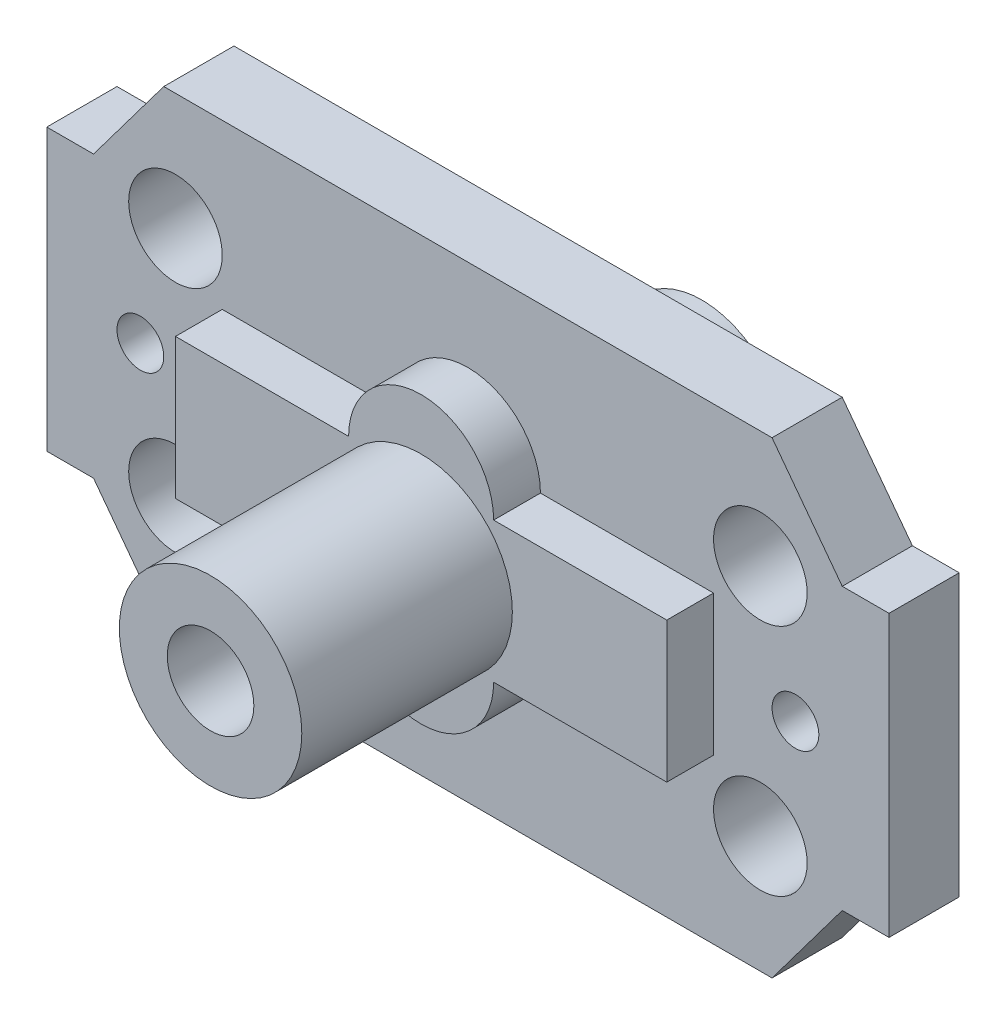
from build123d import *
from build123d.topology import SkipClean

# Parameters (mm, degrees)
PLAQUE_DEPTH              = 1.5
CENTRAGE_SUPERIEUR_DEPTH  = 1
ESQUISSE6_R               = 1.95
GUIDAGE_SUPERIEUR_DEPTH   = 5.5
ESQUISSE8_R               = 0.5
CENTRAGE_INF_RIEUR_DEPTH  = 1
CONG_CENTRAGE_INF_RIEUR_R = 0.5
ESQUISSE7_R               = 1.8
GUIDAGE_INFERIEUR_DEPTH   = 3.5
PER_AGE_DEPTH             = 12.67261753
PER_AGE_DEPTH_BACK        = 12.67261753
ESQUISSE3_R               = 0.5
ESQUISSE3_R_2             = 1
ESQUISSE3_R_3             = 0.9251361


with BuildPart() as part:
    # Esquisse1 → plaque (new body)
    with BuildSketch(Plane.XY):
        Polygon((0, 0), (0, 5), (6.5, 5), (8, 3), (9, 3), (9, 0), align=None)
    extrude(amount=PLAQUE_DEPTH)

    # Esquisse2 → centrage superieur (add)
    with BuildSketch(Plane.XY.offset(1.5)):
        with BuildLine():
            Line((0, 0), (5.25, 0))
            Line((5.25, 0), (5.25, 1.5))
            Line((5.25, 1.5), (1.55, 1.5))
            ThreePointArc((1.55, 1.5), (-1.096015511, 2.596015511), (0, -0.05))
            Line((0, -0.05), (0, 0))
        make_face()
    extrude(amount=CENTRAGE_SUPERIEUR_DEPTH)

    # Esquisse6 → guidage superieur (add)
    with BuildSketch(Plane.XY.offset(1.5)):
        Circle(ESQUISSE6_R)
    extrude(amount=GUIDAGE_SUPERIEUR_DEPTH)

    # Esquisse8 → centrage inf_rieur (add)
    with BuildSketch(Plane(origin=(0, 0, 0), x_dir=(-1, 0, 0), z_dir=(0, 0, -1))):
        with Locations(Location((-3.5, 2, 0), (0, 0, 180))):
            Circle(ESQUISSE8_R)
    extrude(amount=CENTRAGE_INF_RIEUR_DEPTH)

    # Cong_ centrage inf_rieur
    cong_centrage_inf_rieur_edges = [part.edges().sort_by_distance(p)[0] for p in [
        (3, 2, -1),
    ]]
    fillet(cong_centrage_inf_rieur_edges, radius=CONG_CENTRAGE_INF_RIEUR_R)

    # Esquisse7 → guidage inferieur (add)
    with BuildSketch(Plane(origin=(0, 0, 0), x_dir=(-1, 0, 0), z_dir=(0, 0, -1))):
        with Locations(Location((0, 0, 0), (0, 0, 180))):
            Circle(ESQUISSE7_R)
    extrude(amount=GUIDAGE_INFERIEUR_DEPTH)

    # Esquisse3 → per_age (cut, two sides: drawn at the far end of the back side and taken through both)
    with BuildSketch(Plane.XY.offset(1.5).offset(-PER_AGE_DEPTH_BACK)):
        with Locations((7, 0)):
            Circle(ESQUISSE3_R)
        with Locations((6.25, 2.5)):
            Circle(ESQUISSE3_R_2)
        Circle(ESQUISSE3_R_3)
    extrude(amount=PER_AGE_DEPTH + PER_AGE_DEPTH_BACK, mode=Mode.SUBTRACT)

    # Sym_trie1: part across face


with BuildPart() as part_1:
    with SkipClean():  # the faces are left unmerged after this step: merging them gives an invalid solid
        add(part.part)
        add(part.part.mirror(Plane(origin=(3.68071544, 0, 1.103703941), x_dir=(0, 0, 1), z_dir=(0, -1, 0))))

    # Sym_trie2: part across plane


with BuildPart() as part_2:
    with SkipClean():  # the faces are left unmerged after this step: merging them gives an invalid solid
        add(part_1.part)
        add(part_1.part.mirror(Plane(origin=(0, 0, 1.5), x_dir=(0, 0, 1), z_dir=(1, 0, 0))))


solid = part_2.part
